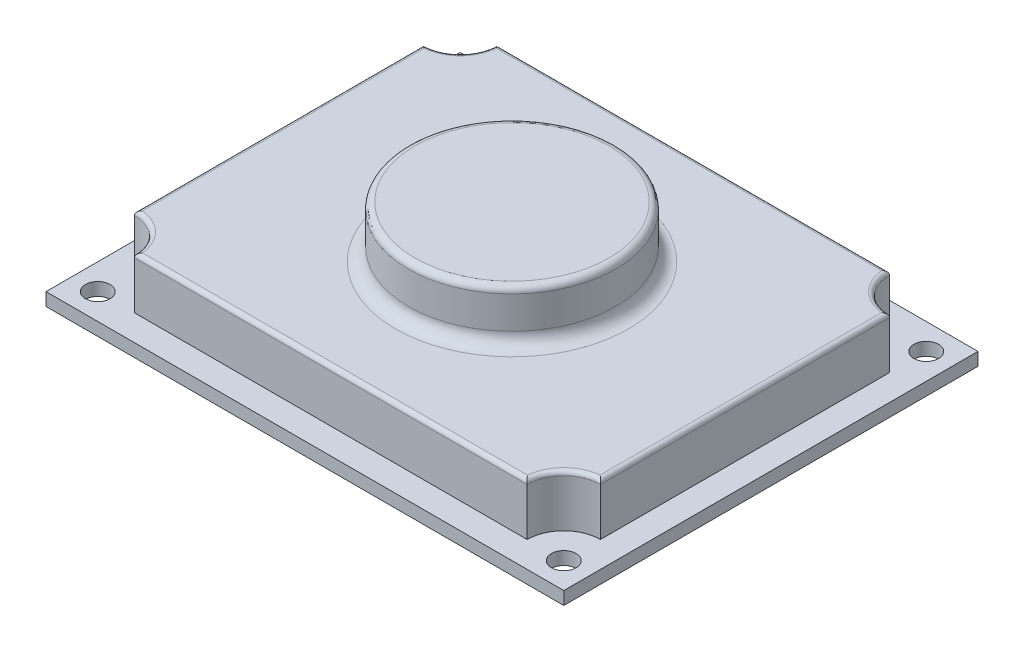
ISO-10303-21;
HEADER;
FILE_DESCRIPTION(('STEP AP214'),'2;1');
FILE_NAME('part.step','',(''),(''),'','','');
FILE_SCHEMA(('AUTOMOTIVE_DESIGN { 1 0 10303 214 1 1 1 1 }'));
ENDSEC;
DATA;
#1=APPLICATION_CONTEXT('core data for automotive mechanical design processes');
#2=APPLICATION_PROTOCOL_DEFINITION('international standard','automotive_design',2000,#1);
#3=PRODUCT_CONTEXT('',#1,'mechanical');
#4=PRODUCT('Part','Part','',(#3));
#5=PRODUCT_RELATED_PRODUCT_CATEGORY('part','',(#4));
#6=PRODUCT_DEFINITION_FORMATION('','',#4);
#7=PRODUCT_DEFINITION_CONTEXT('part definition',#1,'design');
#8=PRODUCT_DEFINITION('design','',#6,#7);
#9=PRODUCT_DEFINITION_SHAPE('','',#8);
#10=(LENGTH_UNIT() NAMED_UNIT(*) SI_UNIT(.MILLI.,.METRE.));
#11=(NAMED_UNIT(*) PLANE_ANGLE_UNIT() SI_UNIT($,.RADIAN.));
#12=(NAMED_UNIT(*) SI_UNIT($,.STERADIAN.) SOLID_ANGLE_UNIT());
#13=UNCERTAINTY_MEASURE_WITH_UNIT(LENGTH_MEASURE(1.E-05),#10,'distance_accuracy_value','');
#14=(GEOMETRIC_REPRESENTATION_CONTEXT(3) GLOBAL_UNCERTAINTY_ASSIGNED_CONTEXT((#13)) GLOBAL_UNIT_ASSIGNED_CONTEXT((#10,
#11,#12)) REPRESENTATION_CONTEXT('',''));
#15=CARTESIAN_POINT('',(0.,0.,0.));
#16=DIRECTION('',(0.,0.,1.));
#17=DIRECTION('',(1.,0.,0.));
#18=AXIS2_PLACEMENT_3D('',#15,#16,#17);
#19=CARTESIAN_POINT('',(12.7,31.75,-190.5));
#20=DIRECTION('',(0.,1.,0.));
#21=DIRECTION('',(0.,0.,1.));
#22=AXIS2_PLACEMENT_3D('',#19,#20,#21);
#23=PLANE('',#22);
#24=CARTESIAN_POINT('',(127.,31.75,-101.6));
#25=DIRECTION('',(0.,1.,0.));
#26=DIRECTION('',(0.,0.,1.));
#27=AXIS2_PLACEMENT_3D('',#24,#25,#26);
#28=CIRCLE('',#27,57.15);
#29=CARTESIAN_POINT('',(127.,31.75,-44.45));
#30=VERTEX_POINT('',#29);
#31=EDGE_CURVE('E11',#30,#30,#28,.F.);
#32=ORIENTED_EDGE('',*,*,#31,.T.);
#33=EDGE_LOOP('',(#32));
#34=FACE_BOUND('',#33,.T.);
#35=DIRECTION('',(0.,0.,1.));
#36=VECTOR('',#35,1.);
#37=CARTESIAN_POINT('',(14.732,31.75,-30.6605122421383));
#38=LINE('',#37,#36);
#39=CARTESIAN_POINT('',(14.732,31.75,-170.611020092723));
#40=VERTEX_POINT('',#39);
#41=CARTESIAN_POINT('',(14.732,31.75,-32.5889799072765));
#42=VERTEX_POINT('',#41);
#43=EDGE_CURVE('E231',#40,#42,#38,.T.);
#44=ORIENTED_EDGE('',*,*,#43,.T.);
#45=CARTESIAN_POINT('',(12.7,31.75,-12.7));
#46=DIRECTION('',(0.,1.,0.));
#47=DIRECTION('',(0.,0.,1.));
#48=AXIS2_PLACEMENT_3D('',#45,#46,#47);
#49=CIRCLE('',#48,19.9925122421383);
#50=CARTESIAN_POINT('',(32.5889799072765,31.75,-14.732));
#51=VERTEX_POINT('',#50);
#52=EDGE_CURVE('E233',#42,#51,#49,.F.);
#53=ORIENTED_EDGE('',*,*,#52,.T.);
#54=DIRECTION('',(1.,0.,0.));
#55=VECTOR('',#54,1.);
#56=CARTESIAN_POINT('',(223.339487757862,31.75,-14.732));
#57=LINE('',#56,#55);
#58=CARTESIAN_POINT('',(221.411020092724,31.75,-14.732));
#59=VERTEX_POINT('',#58);
#60=EDGE_CURVE('E219',#51,#59,#57,.T.);
#61=ORIENTED_EDGE('',*,*,#60,.T.);
#62=CARTESIAN_POINT('',(241.3,31.75,-12.7));
#63=DIRECTION('',(0.,1.,0.));
#64=DIRECTION('',(0.,0.,1.));
#65=AXIS2_PLACEMENT_3D('',#62,#63,#64);
#66=CIRCLE('',#65,19.9925122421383);
#67=CARTESIAN_POINT('',(239.268,31.75,-32.5889799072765));
#68=VERTEX_POINT('',#67);
#69=EDGE_CURVE('E221',#59,#68,#66,.F.);
#70=ORIENTED_EDGE('',*,*,#69,.T.);
#71=DIRECTION('',(0.,0.,-1.));
#72=VECTOR('',#71,1.);
#73=CARTESIAN_POINT('',(239.268,31.75,-172.539487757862));
#74=LINE('',#73,#72);
#75=CARTESIAN_POINT('',(239.268,31.75,-170.611020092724));
#76=VERTEX_POINT('',#75);
#77=EDGE_CURVE('E223',#68,#76,#74,.T.);
#78=ORIENTED_EDGE('',*,*,#77,.T.);
#79=CARTESIAN_POINT('',(241.3,31.75,-190.5));
#80=DIRECTION('',(0.,1.,0.));
#81=DIRECTION('',(0.,0.,1.));
#82=AXIS2_PLACEMENT_3D('',#79,#80,#81);
#83=CIRCLE('',#82,19.9925122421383);
#84=CARTESIAN_POINT('',(221.411020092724,31.75,-188.468));
#85=VERTEX_POINT('',#84);
#86=EDGE_CURVE('E225',#76,#85,#83,.F.);
#87=ORIENTED_EDGE('',*,*,#86,.T.);
#88=DIRECTION('',(-1.,0.,0.));
#89=VECTOR('',#88,1.);
#90=CARTESIAN_POINT('',(30.6605122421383,31.75,-188.468));
#91=LINE('',#90,#89);
#92=CARTESIAN_POINT('',(32.5889799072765,31.75,-188.468));
#93=VERTEX_POINT('',#92);
#94=EDGE_CURVE('E227',#85,#93,#91,.T.);
#95=ORIENTED_EDGE('',*,*,#94,.T.);
#96=CARTESIAN_POINT('',(12.7,31.75,-190.5));
#97=DIRECTION('',(0.,1.,0.));
#98=DIRECTION('',(0.,0.,1.));
#99=AXIS2_PLACEMENT_3D('',#96,#97,#98);
#100=CIRCLE('',#99,19.9925122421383);
#101=EDGE_CURVE('E229',#93,#40,#100,.F.);
#102=ORIENTED_EDGE('',*,*,#101,.T.);
#103=EDGE_LOOP('',(#44,#53,#61,#70,#78,#87,#95,#102));
#104=FACE_BOUND('',#103,.T.);
#105=ADVANCED_FACE('F31',(#34,#104),#23,.T.);
#106=CARTESIAN_POINT('',(0.,6.35,-203.2));
#107=DIRECTION('',(0.,-1.,0.));
#108=DIRECTION('',(0.,0.,-1.));
#109=AXIS2_PLACEMENT_3D('',#106,#107,#108);
#110=PLANE('',#109);
#111=CARTESIAN_POINT('',(12.7,6.35,-12.7));
#112=DIRECTION('',(0.,-1.,0.));
#113=DIRECTION('',(0.,0.,-1.));
#114=AXIS2_PLACEMENT_3D('',#111,#112,#113);
#115=CIRCLE('',#114,6.05587588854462);
#116=CARTESIAN_POINT('',(12.7,6.35,-18.7558758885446));
#117=VERTEX_POINT('',#116);
#118=EDGE_CURVE('E691',#117,#117,#115,.T.);
#119=ORIENTED_EDGE('',*,*,#118,.T.);
#120=EDGE_LOOP('',(#119));
#121=FACE_BOUND('',#120,.T.);
#122=CARTESIAN_POINT('',(241.3,6.35,-12.7));
#123=DIRECTION('',(0.,-1.,0.));
#124=DIRECTION('',(0.,0.,-1.));
#125=AXIS2_PLACEMENT_3D('',#122,#123,#124);
#126=CIRCLE('',#125,6.05587588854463);
#127=CARTESIAN_POINT('',(241.3,6.35,-18.7558758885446));
#128=VERTEX_POINT('',#127);
#129=EDGE_CURVE('E685',#128,#128,#126,.T.);
#130=ORIENTED_EDGE('',*,*,#129,.T.);
#131=EDGE_LOOP('',(#130));
#132=FACE_BOUND('',#131,.T.);
#133=CARTESIAN_POINT('',(241.3,6.35,-190.5));
#134=DIRECTION('',(0.,-1.,0.));
#135=DIRECTION('',(0.,0.,-1.));
#136=AXIS2_PLACEMENT_3D('',#133,#134,#135);
#137=CIRCLE('',#136,6.05587588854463);
#138=CARTESIAN_POINT('',(241.3,6.35,-196.555875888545));
#139=VERTEX_POINT('',#138);
#140=EDGE_CURVE('E679',#139,#139,#137,.T.);
#141=ORIENTED_EDGE('',*,*,#140,.T.);
#142=EDGE_LOOP('',(#141));
#143=FACE_BOUND('',#142,.T.);
#144=CARTESIAN_POINT('',(12.7,6.35,-190.5));
#145=DIRECTION('',(0.,-1.,0.));
#146=DIRECTION('',(0.,0.,-1.));
#147=AXIS2_PLACEMENT_3D('',#144,#145,#146);
#148=CIRCLE('',#147,6.05587588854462);
#149=CARTESIAN_POINT('',(12.7,6.35,-196.555875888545));
#150=VERTEX_POINT('',#149);
#151=EDGE_CURVE('E167',#150,#150,#148,.T.);
#152=ORIENTED_EDGE('',*,*,#151,.T.);
#153=EDGE_LOOP('',(#152));
#154=FACE_BOUND('',#153,.T.);
#155=DIRECTION('',(1.,0.,0.));
#156=VECTOR('',#155,1.);
#157=CARTESIAN_POINT('',(0.,6.35,0.));
#158=LINE('',#157,#156);
#159=CARTESIAN_POINT('',(0.,6.35,0.));
#160=VERTEX_POINT('',#159);
#161=CARTESIAN_POINT('',(254.,6.35,0.));
#162=VERTEX_POINT('',#161);
#163=EDGE_CURVE('E186',#160,#162,#158,.T.);
#164=ORIENTED_EDGE('',*,*,#163,.T.);
#165=DIRECTION('',(0.,0.,-1.));
#166=VECTOR('',#165,1.);
#167=CARTESIAN_POINT('',(254.,6.35,-203.2));
#168=LINE('',#167,#166);
#169=CARTESIAN_POINT('',(254.,6.35,-203.2));
#170=VERTEX_POINT('',#169);
#171=EDGE_CURVE('E189',#162,#170,#168,.T.);
#172=ORIENTED_EDGE('',*,*,#171,.T.);
#173=DIRECTION('',(-1.,0.,0.));
#174=VECTOR('',#173,1.);
#175=CARTESIAN_POINT('',(0.,6.35,-203.2));
#176=LINE('',#175,#174);
#177=CARTESIAN_POINT('',(0.,6.35,-203.2));
#178=VERTEX_POINT('',#177);
#179=EDGE_CURVE('E191',#170,#178,#176,.T.);
#180=ORIENTED_EDGE('',*,*,#179,.T.);
#181=DIRECTION('',(0.,0.,1.));
#182=VECTOR('',#181,1.);
#183=CARTESIAN_POINT('',(0.,6.35,0.));
#184=LINE('',#183,#182);
#185=EDGE_CURVE('E184',#178,#160,#184,.T.);
#186=ORIENTED_EDGE('',*,*,#185,.T.);
#187=EDGE_LOOP('',(#164,#172,#180,#186));
#188=FACE_BOUND('',#187,.T.);
#189=DIRECTION('',(1.,0.,0.));
#190=VECTOR('',#189,1.);
#191=CARTESIAN_POINT('',(12.7,6.35,-12.7));
#192=LINE('',#191,#190);
#193=CARTESIAN_POINT('',(30.6605122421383,6.35,-12.7));
#194=VERTEX_POINT('',#193);
#195=CARTESIAN_POINT('',(223.339487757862,6.35,-12.7));
#196=VERTEX_POINT('',#195);
#197=EDGE_CURVE('E166',#194,#196,#192,.T.);
#198=ORIENTED_EDGE('',*,*,#197,.F.);
#199=CARTESIAN_POINT('',(12.7,6.35,-12.7));
#200=DIRECTION('',(0.,-1.,0.));
#201=DIRECTION('',(0.,0.,-1.));
#202=AXIS2_PLACEMENT_3D('',#199,#200,#201);
#203=CIRCLE('',#202,17.9605122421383);
#204=CARTESIAN_POINT('',(12.7,6.35,-30.6605122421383));
#205=VERTEX_POINT('',#204);
#206=EDGE_CURVE('E151',#194,#205,#203,.F.);
#207=ORIENTED_EDGE('',*,*,#206,.T.);
#208=DIRECTION('',(0.,0.,1.));
#209=VECTOR('',#208,1.);
#210=CARTESIAN_POINT('',(12.7,6.35,-190.5));
#211=LINE('',#210,#209);
#212=CARTESIAN_POINT('',(12.7,6.35,-172.539487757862));
#213=VERTEX_POINT('',#212);
#214=EDGE_CURVE('E164',#213,#205,#211,.T.);
#215=ORIENTED_EDGE('',*,*,#214,.F.);
#216=CARTESIAN_POINT('',(12.7,6.35,-190.5));
#217=DIRECTION('',(0.,-1.,0.));
#218=DIRECTION('',(0.,0.,-1.));
#219=AXIS2_PLACEMENT_3D('',#216,#217,#218);
#220=CIRCLE('',#219,17.9605122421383);
#221=CARTESIAN_POINT('',(30.6605122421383,6.35,-190.5));
#222=VERTEX_POINT('',#221);
#223=EDGE_CURVE('E453',#213,#222,#220,.F.);
#224=ORIENTED_EDGE('',*,*,#223,.T.);
#225=DIRECTION('',(-1.,0.,0.));
#226=VECTOR('',#225,1.);
#227=CARTESIAN_POINT('',(241.3,6.35,-190.5));
#228=LINE('',#227,#226);
#229=CARTESIAN_POINT('',(223.339487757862,6.35,-190.5));
#230=VERTEX_POINT('',#229);
#231=EDGE_CURVE('E173',#230,#222,#228,.T.);
#232=ORIENTED_EDGE('',*,*,#231,.F.);
#233=CARTESIAN_POINT('',(241.3,6.35,-190.5));
#234=DIRECTION('',(0.,-1.,0.));
#235=DIRECTION('',(0.,0.,-1.));
#236=AXIS2_PLACEMENT_3D('',#233,#234,#235);
#237=CIRCLE('',#236,17.9605122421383);
#238=CARTESIAN_POINT('',(241.3,6.35,-172.539487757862));
#239=VERTEX_POINT('',#238);
#240=EDGE_CURVE('E157',#230,#239,#237,.F.);
#241=ORIENTED_EDGE('',*,*,#240,.T.);
#242=DIRECTION('',(0.,0.,-1.));
#243=VECTOR('',#242,1.);
#244=CARTESIAN_POINT('',(241.3,6.35,-12.7));
#245=LINE('',#244,#243);
#246=CARTESIAN_POINT('',(241.3,6.35,-30.6605122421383));
#247=VERTEX_POINT('',#246);
#248=EDGE_CURVE('E175',#247,#239,#245,.T.);
#249=ORIENTED_EDGE('',*,*,#248,.F.);
#250=CARTESIAN_POINT('',(241.3,6.35,-12.7));
#251=DIRECTION('',(0.,-1.,0.));
#252=DIRECTION('',(0.,0.,-1.));
#253=AXIS2_PLACEMENT_3D('',#250,#251,#252);
#254=CIRCLE('',#253,17.9605122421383);
#255=EDGE_CURVE('E432',#247,#196,#254,.F.);
#256=ORIENTED_EDGE('',*,*,#255,.T.);
#257=EDGE_LOOP('',(#198,#207,#215,#224,#232,#241,#249,#256));
#258=FACE_BOUND('',#257,.T.);
#259=ADVANCED_FACE('F162',(#121,#132,#143,#154,#188,#258),#110,.F.);
#260=CARTESIAN_POINT('',(0.,6.35,0.));
#261=DIRECTION('',(1.,0.,0.));
#262=DIRECTION('',(0.,0.,-1.));
#263=AXIS2_PLACEMENT_3D('',#260,#261,#262);
#264=PLANE('',#263);
#265=DIRECTION('',(0.,0.,1.));
#266=VECTOR('',#265,1.);
#267=CARTESIAN_POINT('',(0.,0.,0.));
#268=LINE('',#267,#266);
#269=CARTESIAN_POINT('',(0.,0.,-203.2));
#270=VERTEX_POINT('',#269);
#271=CARTESIAN_POINT('',(0.,0.,0.));
#272=VERTEX_POINT('',#271);
#273=EDGE_CURVE('E183',#270,#272,#268,.T.);
#274=ORIENTED_EDGE('',*,*,#273,.T.);
#275=DIRECTION('',(0.,-1.,0.));
#276=VECTOR('',#275,1.);
#277=CARTESIAN_POINT('',(0.,6.35,0.));
#278=LINE('',#277,#276);
#279=EDGE_CURVE('E209',#160,#272,#278,.T.);
#280=ORIENTED_EDGE('',*,*,#279,.F.);
#281=ORIENTED_EDGE('',*,*,#185,.F.);
#282=DIRECTION('',(0.,-1.,0.));
#283=VECTOR('',#282,1.);
#284=CARTESIAN_POINT('',(0.,6.35,-203.2));
#285=LINE('',#284,#283);
#286=EDGE_CURVE('E193',#178,#270,#285,.T.);
#287=ORIENTED_EDGE('',*,*,#286,.T.);
#288=EDGE_LOOP('',(#274,#280,#281,#287));
#289=FACE_BOUND('',#288,.T.);
#290=ADVANCED_FACE('F344',(#289),#264,.F.);
#291=CARTESIAN_POINT('',(0.,6.35,0.));
#292=DIRECTION('',(0.,0.,-1.));
#293=DIRECTION('',(-1.,0.,0.));
#294=AXIS2_PLACEMENT_3D('',#291,#292,#293);
#295=PLANE('',#294);
#296=DIRECTION('',(1.,0.,0.));
#297=VECTOR('',#296,1.);
#298=CARTESIAN_POINT('',(0.,0.,0.));
#299=LINE('',#298,#297);
#300=CARTESIAN_POINT('',(254.,0.,0.));
#301=VERTEX_POINT('',#300);
#302=EDGE_CURVE('E196',#272,#301,#299,.T.);
#303=ORIENTED_EDGE('',*,*,#302,.T.);
#304=DIRECTION('',(0.,-1.,0.));
#305=VECTOR('',#304,1.);
#306=CARTESIAN_POINT('',(254.,6.35,0.));
#307=LINE('',#306,#305);
#308=EDGE_CURVE('E206',#162,#301,#307,.T.);
#309=ORIENTED_EDGE('',*,*,#308,.F.);
#310=ORIENTED_EDGE('',*,*,#163,.F.);
#311=ORIENTED_EDGE('',*,*,#279,.T.);
#312=EDGE_LOOP('',(#303,#309,#310,#311));
#313=FACE_BOUND('',#312,.T.);
#314=ADVANCED_FACE('F376',(#313),#295,.F.);
#315=CARTESIAN_POINT('',(254.,6.35,-203.2));
#316=DIRECTION('',(-1.,0.,0.));
#317=DIRECTION('',(0.,0.,1.));
#318=AXIS2_PLACEMENT_3D('',#315,#316,#317);
#319=PLANE('',#318);
#320=DIRECTION('',(0.,0.,-1.));
#321=VECTOR('',#320,1.);
#322=CARTESIAN_POINT('',(254.,0.,-203.2));
#323=LINE('',#322,#321);
#324=CARTESIAN_POINT('',(254.,0.,-203.2));
#325=VERTEX_POINT('',#324);
#326=EDGE_CURVE('E198',#301,#325,#323,.T.);
#327=ORIENTED_EDGE('',*,*,#326,.T.);
#328=DIRECTION('',(0.,-1.,0.));
#329=VECTOR('',#328,1.);
#330=CARTESIAN_POINT('',(254.,6.35,-203.2));
#331=LINE('',#330,#329);
#332=EDGE_CURVE('E203',#170,#325,#331,.T.);
#333=ORIENTED_EDGE('',*,*,#332,.F.);
#334=ORIENTED_EDGE('',*,*,#171,.F.);
#335=ORIENTED_EDGE('',*,*,#308,.T.);
#336=EDGE_LOOP('',(#327,#333,#334,#335));
#337=FACE_BOUND('',#336,.T.);
#338=ADVANCED_FACE('F372',(#337),#319,.F.);
#339=CARTESIAN_POINT('',(0.,6.35,-203.2));
#340=DIRECTION('',(0.,0.,1.));
#341=DIRECTION('',(1.,0.,0.));
#342=AXIS2_PLACEMENT_3D('',#339,#340,#341);
#343=PLANE('',#342);
#344=DIRECTION('',(-1.,0.,0.));
#345=VECTOR('',#344,1.);
#346=CARTESIAN_POINT('',(0.,0.,-203.2));
#347=LINE('',#346,#345);
#348=EDGE_CURVE('E187',#325,#270,#347,.T.);
#349=ORIENTED_EDGE('',*,*,#348,.T.);
#350=ORIENTED_EDGE('',*,*,#286,.F.);
#351=ORIENTED_EDGE('',*,*,#179,.F.);
#352=ORIENTED_EDGE('',*,*,#332,.T.);
#353=EDGE_LOOP('',(#349,#350,#351,#352));
#354=FACE_BOUND('',#353,.T.);
#355=ADVANCED_FACE('F368',(#354),#343,.F.);
#356=CARTESIAN_POINT('',(0.,0.,-203.2));
#357=DIRECTION('',(0.,-1.,0.));
#358=DIRECTION('',(0.,0.,-1.));
#359=AXIS2_PLACEMENT_3D('',#356,#357,#358);
#360=PLANE('',#359);
#361=CARTESIAN_POINT('',(12.7,0.,-12.7));
#362=DIRECTION('',(0.,1.,0.));
#363=DIRECTION('',(0.,0.,1.));
#364=AXIS2_PLACEMENT_3D('',#361,#362,#363);
#365=CIRCLE('',#364,6.05587588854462);
#366=CARTESIAN_POINT('',(12.7,0.,-6.64412411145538));
#367=VERTEX_POINT('',#366);
#368=EDGE_CURVE('E326',#367,#367,#365,.T.);
#369=ORIENTED_EDGE('',*,*,#368,.T.);
#370=EDGE_LOOP('',(#369));
#371=FACE_BOUND('',#370,.T.);
#372=CARTESIAN_POINT('',(241.3,0.,-12.7));
#373=DIRECTION('',(0.,1.,0.));
#374=DIRECTION('',(0.,0.,1.));
#375=AXIS2_PLACEMENT_3D('',#372,#373,#374);
#376=CIRCLE('',#375,6.05587588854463);
#377=CARTESIAN_POINT('',(241.3,0.,-6.64412411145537));
#378=VERTEX_POINT('',#377);
#379=EDGE_CURVE('E688',#378,#378,#376,.T.);
#380=ORIENTED_EDGE('',*,*,#379,.T.);
#381=EDGE_LOOP('',(#380));
#382=FACE_BOUND('',#381,.T.);
#383=CARTESIAN_POINT('',(241.3,0.,-190.5));
#384=DIRECTION('',(0.,1.,0.));
#385=DIRECTION('',(0.,0.,1.));
#386=AXIS2_PLACEMENT_3D('',#383,#384,#385);
#387=CIRCLE('',#386,6.05587588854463);
#388=CARTESIAN_POINT('',(241.3,0.,-184.444124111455));
#389=VERTEX_POINT('',#388);
#390=EDGE_CURVE('E682',#389,#389,#387,.T.);
#391=ORIENTED_EDGE('',*,*,#390,.T.);
#392=EDGE_LOOP('',(#391));
#393=FACE_BOUND('',#392,.T.);
#394=CARTESIAN_POINT('',(12.7,0.,-190.5));
#395=DIRECTION('',(0.,1.,0.));
#396=DIRECTION('',(0.,0.,1.));
#397=AXIS2_PLACEMENT_3D('',#394,#395,#396);
#398=CIRCLE('',#397,6.05587588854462);
#399=CARTESIAN_POINT('',(12.7,0.,-184.444124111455));
#400=VERTEX_POINT('',#399);
#401=EDGE_CURVE('E676',#400,#400,#398,.T.);
#402=ORIENTED_EDGE('',*,*,#401,.T.);
#403=EDGE_LOOP('',(#402));
#404=FACE_BOUND('',#403,.T.);
#405=ORIENTED_EDGE('',*,*,#273,.F.);
#406=ORIENTED_EDGE('',*,*,#348,.F.);
#407=ORIENTED_EDGE('',*,*,#326,.F.);
#408=ORIENTED_EDGE('',*,*,#302,.F.);
#409=EDGE_LOOP('',(#405,#406,#407,#408));
#410=FACE_BOUND('',#409,.T.);
#411=ADVANCED_FACE('F363',(#371,#382,#393,#404,#410),#360,.T.);
#412=CARTESIAN_POINT('',(241.3,31.75,-190.5));
#413=DIRECTION('',(0.,0.,1.));
#414=DIRECTION('',(1.,0.,0.));
#415=AXIS2_PLACEMENT_3D('',#412,#413,#414);
#416=PLANE('',#415);
#417=DIRECTION('',(0.,1.,0.));
#418=VECTOR('',#417,1.);
#419=CARTESIAN_POINT('',(30.6605122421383,-44.45,-190.5));
#420=LINE('',#419,#418);
#421=CARTESIAN_POINT('',(30.6605122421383,29.718,-190.5));
#422=VERTEX_POINT('',#421);
#423=EDGE_CURVE('E177',#222,#422,#420,.T.);
#424=ORIENTED_EDGE('',*,*,#423,.T.);
#425=DIRECTION('',(-1.,0.,0.));
#426=VECTOR('',#425,1.);
#427=CARTESIAN_POINT('',(223.339487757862,29.718,-190.5));
#428=LINE('',#427,#426);
#429=CARTESIAN_POINT('',(223.339487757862,29.718,-190.5));
#430=VERTEX_POINT('',#429);
#431=EDGE_CURVE('E240',#422,#430,#428,.F.);
#432=ORIENTED_EDGE('',*,*,#431,.T.);
#433=DIRECTION('',(0.,1.,0.));
#434=VECTOR('',#433,1.);
#435=CARTESIAN_POINT('',(223.339487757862,-44.45,-190.5));
#436=LINE('',#435,#434);
#437=EDGE_CURVE('E449',#430,#230,#436,.F.);
#438=ORIENTED_EDGE('',*,*,#437,.T.);
#439=ORIENTED_EDGE('',*,*,#231,.T.);
#440=EDGE_LOOP('',(#424,#432,#438,#439));
#441=FACE_BOUND('',#440,.T.);
#442=ADVANCED_FACE('F361',(#441),#416,.F.);
#443=CARTESIAN_POINT('',(12.7,31.75,-190.5));
#444=DIRECTION('',(1.,0.,0.));
#445=DIRECTION('',(0.,0.,-1.));
#446=AXIS2_PLACEMENT_3D('',#443,#444,#445);
#447=PLANE('',#446);
#448=DIRECTION('',(0.,1.,0.));
#449=VECTOR('',#448,1.);
#450=CARTESIAN_POINT('',(12.7,-44.45,-30.6605122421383));
#451=LINE('',#450,#449);
#452=CARTESIAN_POINT('',(12.7,29.718,-30.6605122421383));
#453=VERTEX_POINT('',#452);
#454=EDGE_CURVE('E147',#205,#453,#451,.T.);
#455=ORIENTED_EDGE('',*,*,#454,.T.);
#456=DIRECTION('',(0.,0.,1.));
#457=VECTOR('',#456,1.);
#458=CARTESIAN_POINT('',(12.7,29.718,-172.539487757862));
#459=LINE('',#458,#457);
#460=CARTESIAN_POINT('',(12.7,29.718,-172.539487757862));
#461=VERTEX_POINT('',#460);
#462=EDGE_CURVE('E236',#453,#461,#459,.F.);
#463=ORIENTED_EDGE('',*,*,#462,.T.);
#464=DIRECTION('',(0.,1.,0.));
#465=VECTOR('',#464,1.);
#466=CARTESIAN_POINT('',(12.7,-44.45,-172.539487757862));
#467=LINE('',#466,#465);
#468=EDGE_CURVE('E171',#461,#213,#467,.F.);
#469=ORIENTED_EDGE('',*,*,#468,.T.);
#470=ORIENTED_EDGE('',*,*,#214,.T.);
#471=EDGE_LOOP('',(#455,#463,#469,#470));
#472=FACE_BOUND('',#471,.T.);
#473=ADVANCED_FACE('F169',(#472),#447,.F.);
#474=CARTESIAN_POINT('',(12.7,31.75,-12.7));
#475=DIRECTION('',(0.,0.,-1.));
#476=DIRECTION('',(-1.,0.,0.));
#477=AXIS2_PLACEMENT_3D('',#474,#475,#476);
#478=PLANE('',#477);
#479=DIRECTION('',(0.,1.,0.));
#480=VECTOR('',#479,1.);
#481=CARTESIAN_POINT('',(223.339487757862,-44.45,-12.7));
#482=LINE('',#481,#480);
#483=CARTESIAN_POINT('',(223.339487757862,29.718,-12.7));
#484=VERTEX_POINT('',#483);
#485=EDGE_CURVE('E434',#196,#484,#482,.T.);
#486=ORIENTED_EDGE('',*,*,#485,.T.);
#487=DIRECTION('',(1.,0.,0.));
#488=VECTOR('',#487,1.);
#489=CARTESIAN_POINT('',(30.6605122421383,29.718,-12.7));
#490=LINE('',#489,#488);
#491=CARTESIAN_POINT('',(30.6605122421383,29.718,-12.7));
#492=VERTEX_POINT('',#491);
#493=EDGE_CURVE('E246',#484,#492,#490,.F.);
#494=ORIENTED_EDGE('',*,*,#493,.T.);
#495=DIRECTION('',(0.,1.,0.));
#496=VECTOR('',#495,1.);
#497=CARTESIAN_POINT('',(30.6605122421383,-44.45,-12.7));
#498=LINE('',#497,#496);
#499=EDGE_CURVE('E158',#492,#194,#498,.F.);
#500=ORIENTED_EDGE('',*,*,#499,.T.);
#501=ORIENTED_EDGE('',*,*,#197,.T.);
#502=EDGE_LOOP('',(#486,#494,#500,#501));
#503=FACE_BOUND('',#502,.T.);
#504=ADVANCED_FACE('F355',(#503),#478,.F.);
#505=CARTESIAN_POINT('',(241.3,31.75,-12.7));
#506=DIRECTION('',(-1.,0.,0.));
#507=DIRECTION('',(0.,0.,1.));
#508=AXIS2_PLACEMENT_3D('',#505,#506,#507);
#509=PLANE('',#508);
#510=DIRECTION('',(0.,1.,0.));
#511=VECTOR('',#510,1.);
#512=CARTESIAN_POINT('',(241.3,-44.45,-172.539487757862));
#513=LINE('',#512,#511);
#514=CARTESIAN_POINT('',(241.3,29.718,-172.539487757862));
#515=VERTEX_POINT('',#514);
#516=EDGE_CURVE('E447',#239,#515,#513,.T.);
#517=ORIENTED_EDGE('',*,*,#516,.T.);
#518=DIRECTION('',(0.,0.,-1.));
#519=VECTOR('',#518,1.);
#520=CARTESIAN_POINT('',(241.3,29.718,-30.6605122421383));
#521=LINE('',#520,#519);
#522=CARTESIAN_POINT('',(241.3,29.718,-30.6605122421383));
#523=VERTEX_POINT('',#522);
#524=EDGE_CURVE('E54',#515,#523,#521,.F.);
#525=ORIENTED_EDGE('',*,*,#524,.T.);
#526=DIRECTION('',(0.,1.,0.));
#527=VECTOR('',#526,1.);
#528=CARTESIAN_POINT('',(241.3,-44.45,-30.6605122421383));
#529=LINE('',#528,#527);
#530=EDGE_CURVE('E430',#523,#247,#529,.F.);
#531=ORIENTED_EDGE('',*,*,#530,.T.);
#532=ORIENTED_EDGE('',*,*,#248,.T.);
#533=EDGE_LOOP('',(#517,#525,#531,#532));
#534=FACE_BOUND('',#533,.T.);
#535=ADVANCED_FACE('F352',(#534),#509,.F.);
#536=CARTESIAN_POINT('',(12.7,-44.45,-190.5));
#537=DIRECTION('',(0.,1.,0.));
#538=DIRECTION('',(0.,0.,1.));
#539=AXIS2_PLACEMENT_3D('',#536,#537,#538);
#540=CYLINDRICAL_SURFACE('',#539,17.9605122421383);
#541=ORIENTED_EDGE('',*,*,#468,.F.);
#542=CARTESIAN_POINT('',(12.7,29.718,-190.5));
#543=DIRECTION('',(0.,1.,0.));
#544=DIRECTION('',(0.,0.,1.));
#545=AXIS2_PLACEMENT_3D('',#542,#543,#544);
#546=CIRCLE('',#545,17.9605122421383);
#547=EDGE_CURVE('E238',#461,#422,#546,.T.);
#548=ORIENTED_EDGE('',*,*,#547,.T.);
#549=ORIENTED_EDGE('',*,*,#423,.F.);
#550=ORIENTED_EDGE('',*,*,#223,.F.);
#551=EDGE_LOOP('',(#541,#548,#549,#550));
#552=FACE_BOUND('',#551,.T.);
#553=ADVANCED_FACE('F350',(#552),#540,.F.);
#554=CARTESIAN_POINT('',(241.3,-44.45,-12.7));
#555=DIRECTION('',(0.,1.,0.));
#556=DIRECTION('',(0.,0.,1.));
#557=AXIS2_PLACEMENT_3D('',#554,#555,#556);
#558=CYLINDRICAL_SURFACE('',#557,17.9605122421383);
#559=ORIENTED_EDGE('',*,*,#530,.F.);
#560=CARTESIAN_POINT('',(241.3,29.718,-12.7));
#561=DIRECTION('',(0.,1.,0.));
#562=DIRECTION('',(0.,0.,1.));
#563=AXIS2_PLACEMENT_3D('',#560,#561,#562);
#564=CIRCLE('',#563,17.9605122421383);
#565=EDGE_CURVE('E46',#523,#484,#564,.T.);
#566=ORIENTED_EDGE('',*,*,#565,.T.);
#567=ORIENTED_EDGE('',*,*,#485,.F.);
#568=ORIENTED_EDGE('',*,*,#255,.F.);
#569=EDGE_LOOP('',(#559,#566,#567,#568));
#570=FACE_BOUND('',#569,.T.);
#571=ADVANCED_FACE('F422',(#570),#558,.F.);
#572=CARTESIAN_POINT('',(241.3,-44.45,-190.5));
#573=DIRECTION('',(0.,1.,0.));
#574=DIRECTION('',(0.,0.,1.));
#575=AXIS2_PLACEMENT_3D('',#572,#573,#574);
#576=CYLINDRICAL_SURFACE('',#575,17.9605122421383);
#577=ORIENTED_EDGE('',*,*,#437,.F.);
#578=CARTESIAN_POINT('',(241.3,29.718,-190.5));
#579=DIRECTION('',(0.,1.,0.));
#580=DIRECTION('',(0.,0.,1.));
#581=AXIS2_PLACEMENT_3D('',#578,#579,#580);
#582=CIRCLE('',#581,17.9605122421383);
#583=EDGE_CURVE('E242',#430,#515,#582,.T.);
#584=ORIENTED_EDGE('',*,*,#583,.T.);
#585=ORIENTED_EDGE('',*,*,#516,.F.);
#586=ORIENTED_EDGE('',*,*,#240,.F.);
#587=EDGE_LOOP('',(#577,#584,#585,#586));
#588=FACE_BOUND('',#587,.T.);
#589=ADVANCED_FACE('F420',(#588),#576,.F.);
#590=CARTESIAN_POINT('',(12.7,-44.45,-12.7));
#591=DIRECTION('',(0.,1.,0.));
#592=DIRECTION('',(0.,0.,1.));
#593=AXIS2_PLACEMENT_3D('',#590,#591,#592);
#594=CYLINDRICAL_SURFACE('',#593,17.9605122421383);
#595=ORIENTED_EDGE('',*,*,#499,.F.);
#596=CARTESIAN_POINT('',(12.7,29.718,-12.7));
#597=DIRECTION('',(0.,1.,0.));
#598=DIRECTION('',(0.,0.,1.));
#599=AXIS2_PLACEMENT_3D('',#596,#597,#598);
#600=CIRCLE('',#599,17.9605122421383);
#601=EDGE_CURVE('E154',#492,#453,#600,.T.);
#602=ORIENTED_EDGE('',*,*,#601,.T.);
#603=ORIENTED_EDGE('',*,*,#454,.F.);
#604=ORIENTED_EDGE('',*,*,#206,.F.);
#605=EDGE_LOOP('',(#595,#602,#603,#604));
#606=FACE_BOUND('',#605,.T.);
#607=ADVANCED_FACE('F150',(#606),#594,.F.);
#608=CARTESIAN_POINT('',(12.7,0.,-190.5));
#609=DIRECTION('',(0.,1.,0.));
#610=DIRECTION('',(0.,0.,1.));
#611=AXIS2_PLACEMENT_3D('',#608,#609,#610);
#612=CYLINDRICAL_SURFACE('',#611,6.05587588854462);
#613=ORIENTED_EDGE('',*,*,#401,.F.);
#614=EDGE_LOOP('',(#613));
#615=FACE_BOUND('',#614,.T.);
#616=ORIENTED_EDGE('',*,*,#151,.F.);
#617=EDGE_LOOP('',(#616));
#618=FACE_BOUND('',#617,.T.);
#619=ADVANCED_FACE('F413',(#615,#618),#612,.F.);
#620=CARTESIAN_POINT('',(241.3,0.,-190.5));
#621=DIRECTION('',(0.,1.,0.));
#622=DIRECTION('',(0.,0.,1.));
#623=AXIS2_PLACEMENT_3D('',#620,#621,#622);
#624=CYLINDRICAL_SURFACE('',#623,6.05587588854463);
#625=ORIENTED_EDGE('',*,*,#390,.F.);
#626=EDGE_LOOP('',(#625));
#627=FACE_BOUND('',#626,.T.);
#628=ORIENTED_EDGE('',*,*,#140,.F.);
#629=EDGE_LOOP('',(#628));
#630=FACE_BOUND('',#629,.T.);
#631=ADVANCED_FACE('F409',(#627,#630),#624,.F.);
#632=CARTESIAN_POINT('',(241.3,0.,-12.7));
#633=DIRECTION('',(0.,1.,0.));
#634=DIRECTION('',(0.,0.,1.));
#635=AXIS2_PLACEMENT_3D('',#632,#633,#634);
#636=CYLINDRICAL_SURFACE('',#635,6.05587588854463);
#637=ORIENTED_EDGE('',*,*,#379,.F.);
#638=EDGE_LOOP('',(#637));
#639=FACE_BOUND('',#638,.T.);
#640=ORIENTED_EDGE('',*,*,#129,.F.);
#641=EDGE_LOOP('',(#640));
#642=FACE_BOUND('',#641,.T.);
#643=ADVANCED_FACE('F403',(#639,#642),#636,.F.);
#644=CARTESIAN_POINT('',(12.7,0.,-12.7));
#645=DIRECTION('',(0.,1.,0.));
#646=DIRECTION('',(0.,0.,1.));
#647=AXIS2_PLACEMENT_3D('',#644,#645,#646);
#648=CYLINDRICAL_SURFACE('',#647,6.05587588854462);
#649=ORIENTED_EDGE('',*,*,#368,.F.);
#650=EDGE_LOOP('',(#649));
#651=FACE_BOUND('',#650,.T.);
#652=ORIENTED_EDGE('',*,*,#118,.F.);
#653=EDGE_LOOP('',(#652));
#654=FACE_BOUND('',#653,.T.);
#655=ADVANCED_FACE('F398',(#651,#654),#648,.F.);
#656=CARTESIAN_POINT('',(127.,57.15,-101.6));
#657=DIRECTION('',(0.,-1.,0.));
#658=DIRECTION('',(0.,0.,-1.));
#659=AXIS2_PLACEMENT_3D('',#656,#657,#658);
#660=CYLINDRICAL_SURFACE('',#659,50.8);
#661=CARTESIAN_POINT('',(127.,38.1,-101.6));
#662=DIRECTION('',(0.,1.,0.));
#663=DIRECTION('',(0.,0.,1.));
#664=AXIS2_PLACEMENT_3D('',#661,#662,#663);
#665=CIRCLE('',#664,50.8);
#666=CARTESIAN_POINT('',(127.,38.1,-50.8));
#667=VERTEX_POINT('',#666);
#668=EDGE_CURVE('E39',#667,#667,#665,.T.);
#669=ORIENTED_EDGE('',*,*,#668,.T.);
#670=EDGE_LOOP('',(#669));
#671=FACE_BOUND('',#670,.T.);
#672=CARTESIAN_POINT('',(127.,53.975,-101.6));
#673=DIRECTION('',(0.,1.,0.));
#674=DIRECTION('',(0.,0.,1.));
#675=AXIS2_PLACEMENT_3D('',#672,#673,#674);
#676=CIRCLE('',#675,50.8);
#677=CARTESIAN_POINT('',(127.,53.975,-50.8));
#678=VERTEX_POINT('',#677);
#679=EDGE_CURVE('E215',#678,#678,#676,.F.);
#680=ORIENTED_EDGE('',*,*,#679,.T.);
#681=EDGE_LOOP('',(#680));
#682=FACE_BOUND('',#681,.T.);
#683=ADVANCED_FACE('F330',(#671,#682),#660,.T.);
#684=CARTESIAN_POINT('',(127.,57.15,-101.6));
#685=DIRECTION('',(0.,1.,0.));
#686=DIRECTION('',(0.,0.,1.));
#687=AXIS2_PLACEMENT_3D('',#684,#685,#686);
#688=PLANE('',#687);
#689=CARTESIAN_POINT('',(127.,57.15,-101.6));
#690=DIRECTION('',(0.,1.,0.));
#691=DIRECTION('',(0.,0.,1.));
#692=AXIS2_PLACEMENT_3D('',#689,#690,#691);
#693=CIRCLE('',#692,47.625);
#694=CARTESIAN_POINT('',(127.,57.15,-53.975));
#695=VERTEX_POINT('',#694);
#696=EDGE_CURVE('E212',#695,#695,#693,.T.);
#697=ORIENTED_EDGE('',*,*,#696,.T.);
#698=EDGE_LOOP('',(#697));
#699=FACE_BOUND('',#698,.T.);
#700=ADVANCED_FACE('F385',(#699),#688,.T.);
#701=CARTESIAN_POINT('',(127.,53.975,-101.6));
#702=DIRECTION('',(0.,1.,0.));
#703=DIRECTION('',(0.,0.,1.));
#704=AXIS2_PLACEMENT_3D('',#701,#702,#703);
#705=TOROIDAL_SURFACE('',#704,47.625,3.175);
#706=ORIENTED_EDGE('',*,*,#679,.F.);
#707=EDGE_LOOP('',(#706));
#708=FACE_BOUND('',#707,.T.);
#709=ORIENTED_EDGE('',*,*,#696,.F.);
#710=EDGE_LOOP('',(#709));
#711=FACE_BOUND('',#710,.T.);
#712=ADVANCED_FACE('F383',(#708,#711),#705,.T.);
#713=CARTESIAN_POINT('',(241.3,29.718,-190.5));
#714=DIRECTION('',(0.,1.,0.));
#715=DIRECTION('',(0.,0.,1.));
#716=AXIS2_PLACEMENT_3D('',#713,#714,#715);
#717=TOROIDAL_SURFACE('',#716,19.9925122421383,2.032);
#718=CARTESIAN_POINT('',(223.339487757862,29.718,-190.5));
#719=CARTESIAN_POINT('',(223.339500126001,29.7637886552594,-190.500011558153));
#720=CARTESIAN_POINT('',(223.337940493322,29.8095680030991,-190.498452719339));
#721=CARTESIAN_POINT('',(223.331772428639,29.9006769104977,-190.492283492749));
#722=CARTESIAN_POINT('',(223.327166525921,29.9460068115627,-190.487675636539));
#723=CARTESIAN_POINT('',(223.315054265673,30.0354682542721,-190.475550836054));
#724=CARTESIAN_POINT('',(223.307573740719,30.0796068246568,-190.46805980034));
#725=CARTESIAN_POINT('',(223.289880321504,30.1667618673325,-190.450326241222));
#726=CARTESIAN_POINT('',(223.279667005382,30.2097781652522,-190.440083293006));
#727=CARTESIAN_POINT('',(223.245288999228,30.3364439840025,-190.405568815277));
#728=CARTESIAN_POINT('',(223.217335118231,30.4180707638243,-190.377460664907));
#729=CARTESIAN_POINT('',(223.153090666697,30.5744127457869,-190.31266443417));
#730=CARTESIAN_POINT('',(223.116780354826,30.6491109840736,-190.275956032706));
#731=CARTESIAN_POINT('',(223.020961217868,30.8206200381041,-190.178736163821));
#732=CARTESIAN_POINT('',(222.958109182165,30.9135691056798,-190.114697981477));
#733=CARTESIAN_POINT('',(222.82323064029,31.0839016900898,-189.97645075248));
#734=CARTESIAN_POINT('',(222.751186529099,31.1612545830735,-189.902222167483));
#735=CARTESIAN_POINT('',(222.573927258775,31.3260143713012,-189.718412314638));
#736=CARTESIAN_POINT('',(222.466080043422,31.4070828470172,-189.605697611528));
#737=CARTESIAN_POINT('',(222.243949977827,31.5431791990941,-189.371394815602));
#738=CARTESIAN_POINT('',(222.129661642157,31.5981844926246,-189.249799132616));
#739=CARTESIAN_POINT('',(221.915468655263,31.6768265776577,-189.01979872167));
#740=CARTESIAN_POINT('',(221.815984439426,31.7039358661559,-188.912158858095));
#741=CARTESIAN_POINT('',(221.616525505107,31.7403160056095,-188.694671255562));
#742=CARTESIAN_POINT('',(221.516552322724,31.7496255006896,-188.584828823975));
#743=CARTESIAN_POINT('',(221.415058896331,31.7499963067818,-188.472472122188));
#744=CARTESIAN_POINT('',(221.413039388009,31.7499999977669,-188.470236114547));
#745=CARTESIAN_POINT('',(221.411020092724,31.75,-188.468));
#746=B_SPLINE_CURVE_WITH_KNOTS('',3,(#718,#719,#720,#721,#722,#723,#724,#725,#726,#727,#728,
#729,#730,#731,#732,#733,#734,#735,#736,#737,#738,#739,#740,#741,#742,#743,#744,#745),
.UNSPECIFIED.,.F.,.F.,(4,2,2,2,2,2,2,2,2,2,2,2,2,4),(0.,0.137297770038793,0.274481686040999,
0.410460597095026,0.546460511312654,0.817372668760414,1.08893152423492,1.47435948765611,
1.86053704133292,2.38516955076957,2.91025580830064,3.35640794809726,3.80159036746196,
3.810629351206),.UNSPECIFIED.);
#747=EDGE_CURVE('E309',#85,#430,#746,.F.);
#748=ORIENTED_EDGE('',*,*,#747,.F.);
#749=ORIENTED_EDGE('',*,*,#86,.F.);
#750=CARTESIAN_POINT('',(241.3,29.718,-172.539487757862));
#751=CARTESIAN_POINT('',(241.300011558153,29.7637886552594,-172.539500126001));
#752=CARTESIAN_POINT('',(241.298452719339,29.8095680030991,-172.537940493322));
#753=CARTESIAN_POINT('',(241.292283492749,29.9006769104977,-172.531772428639));
#754=CARTESIAN_POINT('',(241.287675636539,29.9460068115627,-172.527166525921));
#755=CARTESIAN_POINT('',(241.275550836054,30.0354682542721,-172.515054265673));
#756=CARTESIAN_POINT('',(241.26805980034,30.0796068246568,-172.507573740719));
#757=CARTESIAN_POINT('',(241.250326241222,30.1667618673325,-172.489880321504));
#758=CARTESIAN_POINT('',(241.240083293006,30.2097781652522,-172.479667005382));
#759=CARTESIAN_POINT('',(241.205568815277,30.3364439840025,-172.445288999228));
#760=CARTESIAN_POINT('',(241.177460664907,30.4180707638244,-172.417335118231));
#761=CARTESIAN_POINT('',(241.11266443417,30.5744127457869,-172.353090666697));
#762=CARTESIAN_POINT('',(241.075956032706,30.6491109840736,-172.316780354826));
#763=CARTESIAN_POINT('',(240.978736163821,30.8206200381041,-172.220961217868));
#764=CARTESIAN_POINT('',(240.914697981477,30.9135691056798,-172.158109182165));
#765=CARTESIAN_POINT('',(240.77645075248,31.0839016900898,-172.02323064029));
#766=CARTESIAN_POINT('',(240.702222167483,31.1612545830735,-171.951186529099));
#767=CARTESIAN_POINT('',(240.518412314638,31.3260143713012,-171.773927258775));
#768=CARTESIAN_POINT('',(240.405697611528,31.4070828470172,-171.666080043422));
#769=CARTESIAN_POINT('',(240.171394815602,31.5431791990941,-171.443949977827));
#770=CARTESIAN_POINT('',(240.049799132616,31.5981844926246,-171.329661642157));
#771=CARTESIAN_POINT('',(239.81979872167,31.6768265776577,-171.115468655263));
#772=CARTESIAN_POINT('',(239.712158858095,31.7039358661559,-171.015984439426));
#773=CARTESIAN_POINT('',(239.494671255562,31.7403160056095,-170.816525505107));
#774=CARTESIAN_POINT('',(239.384828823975,31.7496255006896,-170.716552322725));
#775=CARTESIAN_POINT('',(239.272472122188,31.7499963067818,-170.615058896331));
#776=CARTESIAN_POINT('',(239.270236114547,31.7499999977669,-170.613039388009));
#777=CARTESIAN_POINT('',(239.268,31.75,-170.611020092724));
#778=B_SPLINE_CURVE_WITH_KNOTS('',3,(#750,#751,#752,#753,#754,#755,#756,#757,#758,#759,#760,
#761,#762,#763,#764,#765,#766,#767,#768,#769,#770,#771,#772,#773,#774,#775,#776,#777),
.UNSPECIFIED.,.F.,.F.,(4,2,2,2,2,2,2,2,2,2,2,2,2,4),(0.,0.137297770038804,0.274481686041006,
0.410460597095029,0.546460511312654,0.817372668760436,1.08893152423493,1.47435948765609,
1.86053704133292,2.38516955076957,2.91025580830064,3.35640794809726,3.80159036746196,
3.810629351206),.UNSPECIFIED.);
#779=EDGE_CURVE('E321',#515,#76,#778,.T.);
#780=ORIENTED_EDGE('',*,*,#779,.F.);
#781=ORIENTED_EDGE('',*,*,#583,.F.);
#782=EDGE_LOOP('',(#748,#749,#780,#781));
#783=FACE_BOUND('',#782,.T.);
#784=ADVANCED_FACE('F317',(#783),#717,.T.);
#785=CARTESIAN_POINT('',(239.268,29.718,-190.5));
#786=DIRECTION('',(0.,0.,1.));
#787=DIRECTION('',(1.,0.,0.));
#788=AXIS2_PLACEMENT_3D('',#785,#786,#787);
#789=CYLINDRICAL_SURFACE('',#788,2.032);
#790=ORIENTED_EDGE('',*,*,#779,.T.);
#791=ORIENTED_EDGE('',*,*,#77,.F.);
#792=CARTESIAN_POINT('',(241.3,29.718,-30.6605122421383));
#793=CARTESIAN_POINT('',(241.300011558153,29.7637886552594,-30.6604998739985));
#794=CARTESIAN_POINT('',(241.298452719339,29.8095680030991,-30.6620595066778));
#795=CARTESIAN_POINT('',(241.292283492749,29.9006769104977,-30.668227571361));
#796=CARTESIAN_POINT('',(241.287675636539,29.9460068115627,-30.6728334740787));
#797=CARTESIAN_POINT('',(241.275550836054,30.0354682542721,-30.6849457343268));
#798=CARTESIAN_POINT('',(241.26805980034,30.0796068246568,-30.6924262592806));
#799=CARTESIAN_POINT('',(241.250326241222,30.1667618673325,-30.7101196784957));
#800=CARTESIAN_POINT('',(241.240083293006,30.2097781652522,-30.7203329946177));
#801=CARTESIAN_POINT('',(241.205568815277,30.3364439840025,-30.7547110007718));
#802=CARTESIAN_POINT('',(241.177460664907,30.4180707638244,-30.7826648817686));
#803=CARTESIAN_POINT('',(241.11266443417,30.5744127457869,-30.8469093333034));
#804=CARTESIAN_POINT('',(241.075956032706,30.6491109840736,-30.8832196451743));
#805=CARTESIAN_POINT('',(240.978736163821,30.8206200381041,-30.9790387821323));
#806=CARTESIAN_POINT('',(240.914697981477,30.9135691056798,-31.041890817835));
#807=CARTESIAN_POINT('',(240.77645075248,31.0839016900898,-31.17676935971));
#808=CARTESIAN_POINT('',(240.702222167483,31.1612545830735,-31.248813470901));
#809=CARTESIAN_POINT('',(240.518412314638,31.3260143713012,-31.4260727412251));
#810=CARTESIAN_POINT('',(240.405697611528,31.4070828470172,-31.5339199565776));
#811=CARTESIAN_POINT('',(240.171394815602,31.543179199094,-31.7560500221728));
#812=CARTESIAN_POINT('',(240.049799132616,31.5981844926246,-31.8703383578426));
#813=CARTESIAN_POINT('',(239.81979872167,31.6768265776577,-32.0845313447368));
#814=CARTESIAN_POINT('',(239.712158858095,31.7039358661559,-32.1840155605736));
#815=CARTESIAN_POINT('',(239.494671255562,31.7403160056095,-32.3834744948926));
#816=CARTESIAN_POINT('',(239.384828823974,31.7496255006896,-32.4834476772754));
#817=CARTESIAN_POINT('',(239.272472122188,31.7499963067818,-32.5849411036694));
#818=CARTESIAN_POINT('',(239.270236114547,31.7499999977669,-32.5869606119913));
#819=CARTESIAN_POINT('',(239.268,31.75,-32.5889799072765));
#820=B_SPLINE_CURVE_WITH_KNOTS('',3,(#792,#793,#794,#795,#796,#797,#798,#799,#800,#801,#802,
#803,#804,#805,#806,#807,#808,#809,#810,#811,#812,#813,#814,#815,#816,#817,#818,#819),
.UNSPECIFIED.,.F.,.F.,(4,2,2,2,2,2,2,2,2,2,2,2,2,4),(0.,0.1372977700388,0.274481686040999,
0.410460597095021,0.546460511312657,0.817372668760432,1.08893152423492,1.47435948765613,
1.86053704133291,2.38516955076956,2.9102558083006,3.35640794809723,3.80159036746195,
3.81062935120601),.UNSPECIFIED.);
#821=EDGE_CURVE('E303',#523,#68,#820,.T.);
#822=ORIENTED_EDGE('',*,*,#821,.F.);
#823=ORIENTED_EDGE('',*,*,#524,.F.);
#824=EDGE_LOOP('',(#790,#791,#822,#823));
#825=FACE_BOUND('',#824,.T.);
#826=ADVANCED_FACE('F314',(#825),#789,.T.);
#827=CARTESIAN_POINT('',(12.7,29.718,-188.468));
#828=DIRECTION('',(1.,0.,0.));
#829=DIRECTION('',(0.,0.,-1.));
#830=AXIS2_PLACEMENT_3D('',#827,#828,#829);
#831=CYLINDRICAL_SURFACE('',#830,2.032);
#832=ORIENTED_EDGE('',*,*,#747,.T.);
#833=ORIENTED_EDGE('',*,*,#431,.F.);
#834=CARTESIAN_POINT('',(30.6605122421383,29.718,-190.5));
#835=CARTESIAN_POINT('',(30.6604998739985,29.7637886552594,-190.500011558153));
#836=CARTESIAN_POINT('',(30.6620595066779,29.8095680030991,-190.498452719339));
#837=CARTESIAN_POINT('',(30.6682275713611,29.9006769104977,-190.492283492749));
#838=CARTESIAN_POINT('',(30.6728334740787,29.9460068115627,-190.487675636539));
#839=CARTESIAN_POINT('',(30.6849457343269,30.0354682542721,-190.475550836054));
#840=CARTESIAN_POINT('',(30.6924262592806,30.0796068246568,-190.46805980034));
#841=CARTESIAN_POINT('',(30.7101196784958,30.1667618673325,-190.450326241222));
#842=CARTESIAN_POINT('',(30.7203329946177,30.2097781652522,-190.440083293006));
#843=CARTESIAN_POINT('',(30.7547110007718,30.3364439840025,-190.405568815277));
#844=CARTESIAN_POINT('',(30.7826648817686,30.4180707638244,-190.377460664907));
#845=CARTESIAN_POINT('',(30.8469093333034,30.5744127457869,-190.31266443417));
#846=CARTESIAN_POINT('',(30.8832196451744,30.6491109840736,-190.275956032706));
#847=CARTESIAN_POINT('',(30.9790387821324,30.8206200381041,-190.178736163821));
#848=CARTESIAN_POINT('',(31.0418908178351,30.9135691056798,-190.114697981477));
#849=CARTESIAN_POINT('',(31.17676935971,31.0839016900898,-189.97645075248));
#850=CARTESIAN_POINT('',(31.248813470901,31.1612545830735,-189.902222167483));
#851=CARTESIAN_POINT('',(31.4260727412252,31.3260143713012,-189.718412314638));
#852=CARTESIAN_POINT('',(31.5339199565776,31.4070828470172,-189.605697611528));
#853=CARTESIAN_POINT('',(31.7560500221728,31.5431791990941,-189.371394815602));
#854=CARTESIAN_POINT('',(31.8703383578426,31.5981844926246,-189.249799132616));
#855=CARTESIAN_POINT('',(32.0845313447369,31.6768265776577,-189.01979872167));
#856=CARTESIAN_POINT('',(32.1840155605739,31.7039358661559,-188.912158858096));
#857=CARTESIAN_POINT('',(32.3834744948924,31.7403160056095,-188.694671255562));
#858=CARTESIAN_POINT('',(32.4834476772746,31.7496255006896,-188.584828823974));
#859=CARTESIAN_POINT('',(32.5849411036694,31.7499963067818,-188.472472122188));
#860=CARTESIAN_POINT('',(32.5869606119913,31.7499999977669,-188.470236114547));
#861=CARTESIAN_POINT('',(32.5889799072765,31.75,-188.468));
#862=B_SPLINE_CURVE_WITH_KNOTS('',3,(#834,#835,#836,#837,#838,#839,#840,#841,#842,#843,#844,
#845,#846,#847,#848,#849,#850,#851,#852,#853,#854,#855,#856,#857,#858,#859,#860,#861),
.UNSPECIFIED.,.F.,.F.,(4,2,2,2,2,2,2,2,2,2,2,2,2,4),(0.,0.137297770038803,0.274481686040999,
0.410460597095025,0.546460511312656,0.817372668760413,1.08893152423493,1.47435948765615,
1.86053704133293,2.38516955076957,2.91025580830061,3.35640794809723,3.80159036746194,
3.81062935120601),.UNSPECIFIED.);
#863=EDGE_CURVE('E285',#93,#422,#862,.F.);
#864=ORIENTED_EDGE('',*,*,#863,.F.);
#865=ORIENTED_EDGE('',*,*,#94,.F.);
#866=EDGE_LOOP('',(#832,#833,#864,#865));
#867=FACE_BOUND('',#866,.T.);
#868=ADVANCED_FACE('F298',(#867),#831,.T.);
#869=CARTESIAN_POINT('',(241.3,29.718,-12.7));
#870=DIRECTION('',(0.,1.,0.));
#871=DIRECTION('',(0.,0.,1.));
#872=AXIS2_PLACEMENT_3D('',#869,#870,#871);
#873=TOROIDAL_SURFACE('',#872,19.9925122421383,2.032);
#874=ORIENTED_EDGE('',*,*,#821,.T.);
#875=ORIENTED_EDGE('',*,*,#69,.F.);
#876=CARTESIAN_POINT('',(223.339487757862,29.718,-12.7));
#877=CARTESIAN_POINT('',(223.339500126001,29.7637886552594,-12.6999884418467));
#878=CARTESIAN_POINT('',(223.337940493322,29.8095680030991,-12.7015472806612));
#879=CARTESIAN_POINT('',(223.331772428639,29.9006769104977,-12.7077165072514));
#880=CARTESIAN_POINT('',(223.327166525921,29.9460068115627,-12.7123243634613));
#881=CARTESIAN_POINT('',(223.315054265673,30.0354682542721,-12.7244491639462));
#882=CARTESIAN_POINT('',(223.307573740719,30.0796068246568,-12.7319401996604));
#883=CARTESIAN_POINT('',(223.289880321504,30.1667618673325,-12.7496737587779));
#884=CARTESIAN_POINT('',(223.279667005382,30.2097781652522,-12.7599167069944));
#885=CARTESIAN_POINT('',(223.245288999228,30.3364439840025,-12.7944311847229));
#886=CARTESIAN_POINT('',(223.217335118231,30.4180707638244,-12.8225393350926));
#887=CARTESIAN_POINT('',(223.153090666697,30.5744127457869,-12.8873355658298));
#888=CARTESIAN_POINT('',(223.116780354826,30.6491109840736,-12.9240439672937));
#889=CARTESIAN_POINT('',(223.020961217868,30.8206200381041,-13.0212638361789));
#890=CARTESIAN_POINT('',(222.958109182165,30.9135691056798,-13.0853020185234));
#891=CARTESIAN_POINT('',(222.82323064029,31.0839016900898,-13.22354924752));
#892=CARTESIAN_POINT('',(222.751186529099,31.1612545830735,-13.2977778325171));
#893=CARTESIAN_POINT('',(222.573927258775,31.3260143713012,-13.4815876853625));
#894=CARTESIAN_POINT('',(222.466080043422,31.4070828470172,-13.5943023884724));
#895=CARTESIAN_POINT('',(222.243949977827,31.5431791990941,-13.828605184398));
#896=CARTESIAN_POINT('',(222.129661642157,31.5981844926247,-13.9502008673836));
#897=CARTESIAN_POINT('',(221.915468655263,31.6768265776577,-14.1802012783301));
#898=CARTESIAN_POINT('',(221.815984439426,31.7039358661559,-14.2878411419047));
#899=CARTESIAN_POINT('',(221.616525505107,31.7403160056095,-14.5053287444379));
#900=CARTESIAN_POINT('',(221.516552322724,31.7496255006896,-14.6151711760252));
#901=CARTESIAN_POINT('',(221.415058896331,31.7499963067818,-14.7275278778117));
#902=CARTESIAN_POINT('',(221.413039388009,31.7499999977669,-14.729763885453));
#903=CARTESIAN_POINT('',(221.411020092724,31.75,-14.732));
#904=B_SPLINE_CURVE_WITH_KNOTS('',3,(#876,#877,#878,#879,#880,#881,#882,#883,#884,#885,#886,
#887,#888,#889,#890,#891,#892,#893,#894,#895,#896,#897,#898,#899,#900,#901,#902,#903),
.UNSPECIFIED.,.F.,.F.,(4,2,2,2,2,2,2,2,2,2,2,2,2,4),(0.,0.137297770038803,0.274481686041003,
0.410460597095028,0.546460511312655,0.817372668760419,1.08893152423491,1.47435948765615,
1.86053704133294,2.38516955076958,2.91025580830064,3.35640794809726,3.80159036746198,
3.810629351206),.UNSPECIFIED.);
#905=EDGE_CURVE('E279',#484,#59,#904,.T.);
#906=ORIENTED_EDGE('',*,*,#905,.F.);
#907=ORIENTED_EDGE('',*,*,#565,.F.);
#908=EDGE_LOOP('',(#874,#875,#906,#907));
#909=FACE_BOUND('',#908,.T.);
#910=ADVANCED_FACE('F295',(#909),#873,.T.);
#911=CARTESIAN_POINT('',(12.7,29.718,-190.5));
#912=DIRECTION('',(0.,1.,0.));
#913=DIRECTION('',(0.,0.,1.));
#914=AXIS2_PLACEMENT_3D('',#911,#912,#913);
#915=TOROIDAL_SURFACE('',#914,19.9925122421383,2.032);
#916=ORIENTED_EDGE('',*,*,#863,.T.);
#917=ORIENTED_EDGE('',*,*,#547,.F.);
#918=CARTESIAN_POINT('',(12.7,29.718,-172.539487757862));
#919=CARTESIAN_POINT('',(12.6999884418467,29.7637886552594,-172.539500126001));
#920=CARTESIAN_POINT('',(12.7015472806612,29.8095680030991,-172.537940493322));
#921=CARTESIAN_POINT('',(12.7077165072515,29.9006769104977,-172.531772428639));
#922=CARTESIAN_POINT('',(12.7123243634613,29.9460068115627,-172.527166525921));
#923=CARTESIAN_POINT('',(12.7244491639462,30.0354682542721,-172.515054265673));
#924=CARTESIAN_POINT('',(12.7319401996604,30.0796068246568,-172.507573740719));
#925=CARTESIAN_POINT('',(12.7496737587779,30.1667618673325,-172.489880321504));
#926=CARTESIAN_POINT('',(12.7599167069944,30.2097781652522,-172.479667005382));
#927=CARTESIAN_POINT('',(12.7944311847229,30.3364439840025,-172.445288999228));
#928=CARTESIAN_POINT('',(12.8225393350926,30.4180707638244,-172.417335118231));
#929=CARTESIAN_POINT('',(12.8873355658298,30.5744127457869,-172.353090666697));
#930=CARTESIAN_POINT('',(12.9240439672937,30.6491109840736,-172.316780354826));
#931=CARTESIAN_POINT('',(13.0212638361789,30.8206200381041,-172.220961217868));
#932=CARTESIAN_POINT('',(13.0853020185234,30.9135691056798,-172.158109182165));
#933=CARTESIAN_POINT('',(13.22354924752,31.0839016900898,-172.02323064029));
#934=CARTESIAN_POINT('',(13.2977778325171,31.1612545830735,-171.951186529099));
#935=CARTESIAN_POINT('',(13.4815876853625,31.3260143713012,-171.773927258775));
#936=CARTESIAN_POINT('',(13.5943023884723,31.4070828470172,-171.666080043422));
#937=CARTESIAN_POINT('',(13.828605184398,31.543179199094,-171.443949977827));
#938=CARTESIAN_POINT('',(13.9502008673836,31.5981844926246,-171.329661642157));
#939=CARTESIAN_POINT('',(14.1802012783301,31.6768265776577,-171.115468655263));
#940=CARTESIAN_POINT('',(14.2878411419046,31.7039358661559,-171.015984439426));
#941=CARTESIAN_POINT('',(14.5053287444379,31.7403160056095,-170.816525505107));
#942=CARTESIAN_POINT('',(14.6151711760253,31.7496255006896,-170.716552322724));
#943=CARTESIAN_POINT('',(14.7275278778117,31.7499963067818,-170.615058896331));
#944=CARTESIAN_POINT('',(14.729763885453,31.7499999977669,-170.613039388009));
#945=CARTESIAN_POINT('',(14.732,31.75,-170.611020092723));
#946=B_SPLINE_CURVE_WITH_KNOTS('',3,(#918,#919,#920,#921,#922,#923,#924,#925,#926,#927,#928,
#929,#930,#931,#932,#933,#934,#935,#936,#937,#938,#939,#940,#941,#942,#943,#944,#945),
.UNSPECIFIED.,.F.,.F.,(4,2,2,2,2,2,2,2,2,2,2,2,2,4),(0.,0.137297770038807,0.274481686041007,
0.410460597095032,0.546460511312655,0.81737266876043,1.08893152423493,1.47435948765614,
1.86053704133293,2.38516955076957,2.91025580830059,3.35640794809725,3.80159036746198,
3.810629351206),.UNSPECIFIED.);
#947=EDGE_CURVE('E286',#40,#461,#946,.F.);
#948=ORIENTED_EDGE('',*,*,#947,.F.);
#949=ORIENTED_EDGE('',*,*,#101,.F.);
#950=EDGE_LOOP('',(#916,#917,#948,#949));
#951=FACE_BOUND('',#950,.T.);
#952=ADVANCED_FACE('F273',(#951),#915,.T.);
#953=CARTESIAN_POINT('',(12.7,29.718,-14.732));
#954=DIRECTION('',(-1.,0.,0.));
#955=DIRECTION('',(0.,0.,1.));
#956=AXIS2_PLACEMENT_3D('',#953,#954,#955);
#957=CYLINDRICAL_SURFACE('',#956,2.032);
#958=ORIENTED_EDGE('',*,*,#905,.T.);
#959=ORIENTED_EDGE('',*,*,#60,.F.);
#960=CARTESIAN_POINT('',(30.6605122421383,29.718,-12.7));
#961=CARTESIAN_POINT('',(30.6604998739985,29.7637886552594,-12.6999884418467));
#962=CARTESIAN_POINT('',(30.6620595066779,29.8095680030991,-12.7015472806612));
#963=CARTESIAN_POINT('',(30.6682275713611,29.9006769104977,-12.7077165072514));
#964=CARTESIAN_POINT('',(30.6728334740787,29.9460068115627,-12.7123243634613));
#965=CARTESIAN_POINT('',(30.6849457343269,30.0354682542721,-12.7244491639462));
#966=CARTESIAN_POINT('',(30.6924262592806,30.0796068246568,-12.7319401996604));
#967=CARTESIAN_POINT('',(30.7101196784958,30.1667618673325,-12.7496737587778));
#968=CARTESIAN_POINT('',(30.7203329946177,30.2097781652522,-12.7599167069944));
#969=CARTESIAN_POINT('',(30.7547110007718,30.3364439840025,-12.7944311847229));
#970=CARTESIAN_POINT('',(30.7826648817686,30.4180707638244,-12.8225393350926));
#971=CARTESIAN_POINT('',(30.8469093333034,30.5744127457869,-12.8873355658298));
#972=CARTESIAN_POINT('',(30.8832196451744,30.6491109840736,-12.9240439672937));
#973=CARTESIAN_POINT('',(30.9790387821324,30.8206200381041,-13.0212638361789));
#974=CARTESIAN_POINT('',(31.0418908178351,30.9135691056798,-13.0853020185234));
#975=CARTESIAN_POINT('',(31.17676935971,31.0839016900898,-13.22354924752));
#976=CARTESIAN_POINT('',(31.248813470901,31.1612545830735,-13.2977778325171));
#977=CARTESIAN_POINT('',(31.4260727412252,31.3260143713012,-13.4815876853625));
#978=CARTESIAN_POINT('',(31.5339199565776,31.4070828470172,-13.5943023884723));
#979=CARTESIAN_POINT('',(31.7560500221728,31.543179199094,-13.828605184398));
#980=CARTESIAN_POINT('',(31.8703383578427,31.5981844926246,-13.9502008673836));
#981=CARTESIAN_POINT('',(32.0845313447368,31.6768265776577,-14.1802012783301));
#982=CARTESIAN_POINT('',(32.1840155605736,31.7039358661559,-14.2878411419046));
#983=CARTESIAN_POINT('',(32.3834744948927,31.7403160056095,-14.5053287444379));
#984=CARTESIAN_POINT('',(32.4834476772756,31.7496255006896,-14.6151711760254));
#985=CARTESIAN_POINT('',(32.5849411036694,31.7499963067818,-14.7275278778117));
#986=CARTESIAN_POINT('',(32.5869606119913,31.7499999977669,-14.729763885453));
#987=CARTESIAN_POINT('',(32.5889799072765,31.75,-14.732));
#988=B_SPLINE_CURVE_WITH_KNOTS('',3,(#960,#961,#962,#963,#964,#965,#966,#967,#968,#969,#970,
#971,#972,#973,#974,#975,#976,#977,#978,#979,#980,#981,#982,#983,#984,#985,#986,#987),
.UNSPECIFIED.,.F.,.F.,(4,2,2,2,2,2,2,2,2,2,2,2,2,4),(0.,0.137297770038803,0.274481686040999,
0.410460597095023,0.546460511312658,0.817372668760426,1.08893152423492,1.47435948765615,
1.86053704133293,2.38516955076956,2.9102558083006,3.35640794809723,3.80159036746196,
3.810629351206),.UNSPECIFIED.);
#989=EDGE_CURVE('E255',#492,#51,#988,.T.);
#990=ORIENTED_EDGE('',*,*,#989,.F.);
#991=ORIENTED_EDGE('',*,*,#493,.F.);
#992=EDGE_LOOP('',(#958,#959,#990,#991));
#993=FACE_BOUND('',#992,.T.);
#994=ADVANCED_FACE('F268',(#993),#957,.T.);
#995=CARTESIAN_POINT('',(14.732,29.718,-190.5));
#996=DIRECTION('',(0.,0.,-1.));
#997=DIRECTION('',(-1.,0.,0.));
#998=AXIS2_PLACEMENT_3D('',#995,#996,#997);
#999=CYLINDRICAL_SURFACE('',#998,2.032);
#1000=ORIENTED_EDGE('',*,*,#947,.T.);
#1001=ORIENTED_EDGE('',*,*,#462,.F.);
#1002=CARTESIAN_POINT('',(12.7,29.718,-30.6605122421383));
#1003=CARTESIAN_POINT('',(12.6999884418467,29.7637886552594,-30.6604998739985));
#1004=CARTESIAN_POINT('',(12.7015472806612,29.8095680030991,-30.6620595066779));
#1005=CARTESIAN_POINT('',(12.7077165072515,29.9006769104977,-30.6682275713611));
#1006=CARTESIAN_POINT('',(12.7123243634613,29.9460068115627,-30.6728334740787));
#1007=CARTESIAN_POINT('',(12.7244491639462,30.0354682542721,-30.6849457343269));
#1008=CARTESIAN_POINT('',(12.7319401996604,30.0796068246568,-30.6924262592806));
#1009=CARTESIAN_POINT('',(12.7496737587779,30.1667618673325,-30.7101196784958));
#1010=CARTESIAN_POINT('',(12.7599167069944,30.2097781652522,-30.7203329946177));
#1011=CARTESIAN_POINT('',(12.7944311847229,30.3364439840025,-30.7547110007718));
#1012=CARTESIAN_POINT('',(12.8225393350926,30.4180707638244,-30.7826648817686));
#1013=CARTESIAN_POINT('',(12.8873355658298,30.5744127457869,-30.8469093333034));
#1014=CARTESIAN_POINT('',(12.9240439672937,30.6491109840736,-30.8832196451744));
#1015=CARTESIAN_POINT('',(13.0212638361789,30.8206200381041,-30.9790387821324));
#1016=CARTESIAN_POINT('',(13.0853020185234,30.9135691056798,-31.0418908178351));
#1017=CARTESIAN_POINT('',(13.22354924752,31.0839016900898,-31.17676935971));
#1018=CARTESIAN_POINT('',(13.2977778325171,31.1612545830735,-31.248813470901));
#1019=CARTESIAN_POINT('',(13.4815876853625,31.3260143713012,-31.4260727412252));
#1020=CARTESIAN_POINT('',(13.5943023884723,31.4070828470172,-31.5339199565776));
#1021=CARTESIAN_POINT('',(13.828605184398,31.543179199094,-31.7560500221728));
#1022=CARTESIAN_POINT('',(13.9502008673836,31.5981844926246,-31.8703383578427));
#1023=CARTESIAN_POINT('',(14.1802012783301,31.6768265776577,-32.0845313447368));
#1024=CARTESIAN_POINT('',(14.2878411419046,31.7039358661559,-32.1840155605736));
#1025=CARTESIAN_POINT('',(14.5053287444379,31.7403160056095,-32.3834744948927));
#1026=CARTESIAN_POINT('',(14.6151711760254,31.7496255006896,-32.4834476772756));
#1027=CARTESIAN_POINT('',(14.7275278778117,31.7499963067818,-32.5849411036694));
#1028=CARTESIAN_POINT('',(14.729763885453,31.7499999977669,-32.5869606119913));
#1029=CARTESIAN_POINT('',(14.732,31.75,-32.5889799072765));
#1030=B_SPLINE_CURVE_WITH_KNOTS('',3,(#1002,#1003,#1004,#1005,#1006,#1007,#1008,#1009,#1010,
#1011,#1012,#1013,#1014,#1015,#1016,#1017,#1018,#1019,#1020,#1021,#1022,#1023,#1024,#1025,#1026,
#1027,#1028,#1029),.UNSPECIFIED.,.F.,.F.,(4,2,2,2,2,2,2,2,2,2,2,2,2,4),(0.,0.137297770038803,
0.274481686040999,0.410460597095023,0.546460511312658,0.817372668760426,1.08893152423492,
1.47435948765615,1.86053704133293,2.38516955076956,2.9102558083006,3.35640794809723,
3.80159036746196,3.810629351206),.UNSPECIFIED.);
#1031=EDGE_CURVE('E248',#42,#453,#1030,.F.);
#1032=ORIENTED_EDGE('',*,*,#1031,.F.);
#1033=ORIENTED_EDGE('',*,*,#43,.F.);
#1034=EDGE_LOOP('',(#1000,#1001,#1032,#1033));
#1035=FACE_BOUND('',#1034,.T.);
#1036=ADVANCED_FACE('F261',(#1035),#999,.T.);
#1037=CARTESIAN_POINT('',(12.7,29.718,-12.7));
#1038=DIRECTION('',(0.,1.,0.));
#1039=DIRECTION('',(0.,0.,1.));
#1040=AXIS2_PLACEMENT_3D('',#1037,#1038,#1039);
#1041=TOROIDAL_SURFACE('',#1040,19.9925122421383,2.032);
#1042=ORIENTED_EDGE('',*,*,#989,.T.);
#1043=ORIENTED_EDGE('',*,*,#52,.F.);
#1044=ORIENTED_EDGE('',*,*,#1031,.T.);
#1045=ORIENTED_EDGE('',*,*,#601,.F.);
#1046=EDGE_LOOP('',(#1042,#1043,#1044,#1045));
#1047=FACE_BOUND('',#1046,.T.);
#1048=ADVANCED_FACE('F264',(#1047),#1041,.T.);
#1049=CARTESIAN_POINT('',(127.,38.1,-101.6));
#1050=DIRECTION('',(0.,1.,0.));
#1051=DIRECTION('',(0.,0.,1.));
#1052=AXIS2_PLACEMENT_3D('',#1049,#1050,#1051);
#1053=TOROIDAL_SURFACE('',#1052,57.15,6.35);
#1054=ORIENTED_EDGE('',*,*,#31,.F.);
#1055=EDGE_LOOP('',(#1054));
#1056=FACE_BOUND('',#1055,.T.);
#1057=ORIENTED_EDGE('',*,*,#668,.F.);
#1058=EDGE_LOOP('',(#1057));
#1059=FACE_BOUND('',#1058,.T.);
#1060=ADVANCED_FACE('F33',(#1056,#1059),#1053,.F.);
#1061=CLOSED_SHELL('',(#105,#259,#290,#314,#338,#355,#411,#442,#473,#504,#535,#553,#571,#589,
#607,#619,#631,#643,#655,#683,#700,#712,#784,#826,#868,#910,#952,#994,#1036,#1048,#1060));
#1062=MANIFOLD_SOLID_BREP('B2',#1061);
#1063=ADVANCED_BREP_SHAPE_REPRESENTATION('',(#18,#1062),#14);
#1064=SHAPE_DEFINITION_REPRESENTATION(#9,#1063);
ENDSEC;
END-ISO-10303-21;
